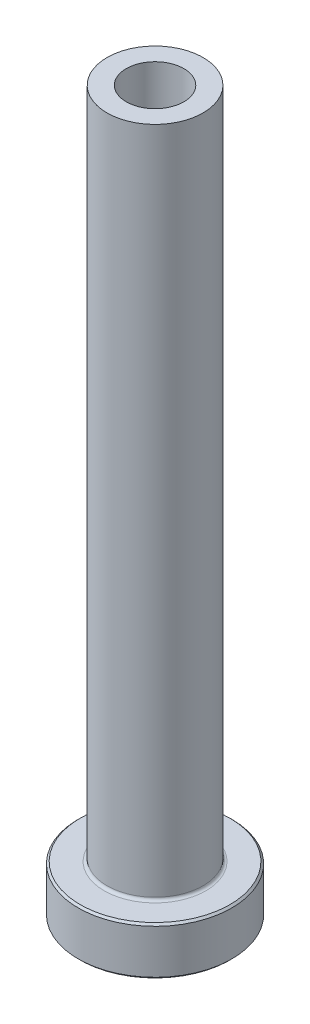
ISO-10303-21;
HEADER;
FILE_DESCRIPTION(('STEP AP214'),'2;1');
FILE_NAME('part.step','',(''),(''),'','','');
FILE_SCHEMA(('AUTOMOTIVE_DESIGN { 1 0 10303 214 1 1 1 1 }'));
ENDSEC;
DATA;
#1=APPLICATION_CONTEXT('core data for automotive mechanical design processes');
#2=APPLICATION_PROTOCOL_DEFINITION('international standard','automotive_design',2000,#1);
#3=PRODUCT_CONTEXT('',#1,'mechanical');
#4=PRODUCT('Part','Part','',(#3));
#5=PRODUCT_RELATED_PRODUCT_CATEGORY('part','',(#4));
#6=PRODUCT_DEFINITION_FORMATION('','',#4);
#7=PRODUCT_DEFINITION_CONTEXT('part definition',#1,'design');
#8=PRODUCT_DEFINITION('design','',#6,#7);
#9=PRODUCT_DEFINITION_SHAPE('','',#8);
#10=(LENGTH_UNIT() NAMED_UNIT(*) SI_UNIT(.MILLI.,.METRE.));
#11=(NAMED_UNIT(*) PLANE_ANGLE_UNIT() SI_UNIT($,.RADIAN.));
#12=(NAMED_UNIT(*) SI_UNIT($,.STERADIAN.) SOLID_ANGLE_UNIT());
#13=UNCERTAINTY_MEASURE_WITH_UNIT(LENGTH_MEASURE(1.E-05),#10,'distance_accuracy_value','');
#14=(GEOMETRIC_REPRESENTATION_CONTEXT(3) GLOBAL_UNCERTAINTY_ASSIGNED_CONTEXT((#13)) GLOBAL_UNIT_ASSIGNED_CONTEXT((#10,
#11,#12)) REPRESENTATION_CONTEXT('',''));
#15=CARTESIAN_POINT('',(0.,0.,0.));
#16=DIRECTION('',(0.,0.,1.));
#17=DIRECTION('',(1.,0.,0.));
#18=AXIS2_PLACEMENT_3D('',#15,#16,#17);
#19=CARTESIAN_POINT('',(0.,92.1876809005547,0.));
#20=DIRECTION('',(0.,1.,0.));
#21=DIRECTION('',(0.,0.,1.));
#22=AXIS2_PLACEMENT_3D('',#19,#20,#21);
#23=CYLINDRICAL_SURFACE('',#22,3.00000000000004);
#24=CARTESIAN_POINT('',(0.,75.,0.));
#25=DIRECTION('',(0.,1.,0.));
#26=DIRECTION('',(0.,0.,1.));
#27=AXIS2_PLACEMENT_3D('',#24,#25,#26);
#28=CIRCLE('',#27,3.00000000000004);
#29=CARTESIAN_POINT('',(0.,75.,3.00000000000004));
#30=VERTEX_POINT('',#29);
#31=EDGE_CURVE('E62',#30,#30,#28,.T.);
#32=ORIENTED_EDGE('',*,*,#31,.T.);
#33=EDGE_LOOP('',(#32));
#34=FACE_BOUND('',#33,.T.);
#35=CARTESIAN_POINT('',(0.,30.,0.));
#36=DIRECTION('',(0.,1.,0.));
#37=DIRECTION('',(0.,0.,1.));
#38=AXIS2_PLACEMENT_3D('',#35,#36,#37);
#39=CIRCLE('',#38,3.00000000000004);
#40=CARTESIAN_POINT('',(0.,30.,3.00000000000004));
#41=VERTEX_POINT('',#40);
#42=EDGE_CURVE('E71',#41,#41,#39,.T.);
#43=ORIENTED_EDGE('',*,*,#42,.F.);
#44=EDGE_LOOP('',(#43));
#45=FACE_BOUND('',#44,.T.);
#46=ADVANCED_FACE('F30',(#34,#45),#23,.F.);
#47=CARTESIAN_POINT('',(-3.00000000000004,75.,0.));
#48=DIRECTION('',(0.,1.,0.));
#49=DIRECTION('',(0.,0.,1.));
#50=AXIS2_PLACEMENT_3D('',#47,#48,#49);
#51=PLANE('',#50);
#52=CARTESIAN_POINT('',(0.,75.,0.));
#53=DIRECTION('',(0.,1.,0.));
#54=DIRECTION('',(0.,0.,1.));
#55=AXIS2_PLACEMENT_3D('',#52,#53,#54);
#56=CIRCLE('',#55,5.);
#57=CARTESIAN_POINT('',(0.,75.,5.));
#58=VERTEX_POINT('',#57);
#59=EDGE_CURVE('E65',#58,#58,#56,.T.);
#60=ORIENTED_EDGE('',*,*,#59,.T.);
#61=EDGE_LOOP('',(#60));
#62=FACE_BOUND('',#61,.T.);
#63=ORIENTED_EDGE('',*,*,#31,.F.);
#64=EDGE_LOOP('',(#63));
#65=FACE_BOUND('',#64,.T.);
#66=ADVANCED_FACE('F79',(#62,#65),#51,.T.);
#67=CARTESIAN_POINT('',(0.,92.1876809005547,0.));
#68=DIRECTION('',(0.,1.,0.));
#69=DIRECTION('',(0.,0.,1.));
#70=AXIS2_PLACEMENT_3D('',#67,#68,#69);
#71=CYLINDRICAL_SURFACE('',#70,4.99999999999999);
#72=CARTESIAN_POINT('',(0.,5.3,0.));
#73=DIRECTION('',(0.,1.,0.));
#74=DIRECTION('',(0.,0.,1.));
#75=AXIS2_PLACEMENT_3D('',#72,#73,#74);
#76=CIRCLE('',#75,4.99999999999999);
#77=CARTESIAN_POINT('',(0.,5.3,4.99999999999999));
#78=VERTEX_POINT('',#77);
#79=EDGE_CURVE('E59',#78,#78,#76,.T.);
#80=ORIENTED_EDGE('',*,*,#79,.T.);
#81=EDGE_LOOP('',(#80));
#82=FACE_BOUND('',#81,.T.);
#83=ORIENTED_EDGE('',*,*,#59,.F.);
#84=EDGE_LOOP('',(#83));
#85=FACE_BOUND('',#84,.T.);
#86=ADVANCED_FACE('F85',(#82,#85),#71,.T.);
#87=CARTESIAN_POINT('',(-4.99999999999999,5.,0.));
#88=DIRECTION('',(0.,1.,0.));
#89=DIRECTION('',(0.,0.,1.));
#90=AXIS2_PLACEMENT_3D('',#87,#88,#89);
#91=PLANE('',#90);
#92=CARTESIAN_POINT('',(0.,5.,0.));
#93=DIRECTION('',(0.,1.,0.));
#94=DIRECTION('',(0.,0.,1.));
#95=AXIS2_PLACEMENT_3D('',#92,#93,#94);
#96=CIRCLE('',#95,7.80000000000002);
#97=CARTESIAN_POINT('',(0.,5.,-7.80000000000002));
#98=VERTEX_POINT('',#97);
#99=EDGE_CURVE('E53',#98,#98,#96,.T.);
#100=ORIENTED_EDGE('',*,*,#99,.T.);
#101=EDGE_LOOP('',(#100));
#102=FACE_BOUND('',#101,.T.);
#103=CARTESIAN_POINT('',(0.,5.,0.));
#104=DIRECTION('',(0.,1.,0.));
#105=DIRECTION('',(0.,0.,1.));
#106=AXIS2_PLACEMENT_3D('',#103,#104,#105);
#107=CIRCLE('',#106,5.29999999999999);
#108=CARTESIAN_POINT('',(0.,5.,5.29999999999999));
#109=VERTEX_POINT('',#108);
#110=EDGE_CURVE('E56',#109,#109,#107,.F.);
#111=ORIENTED_EDGE('',*,*,#110,.T.);
#112=EDGE_LOOP('',(#111));
#113=FACE_BOUND('',#112,.T.);
#114=ADVANCED_FACE('F111',(#102,#113),#91,.T.);
#115=CARTESIAN_POINT('',(0.,92.1876809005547,0.));
#116=DIRECTION('',(0.,1.,0.));
#117=DIRECTION('',(0.,0.,1.));
#118=AXIS2_PLACEMENT_3D('',#115,#116,#117);
#119=CYLINDRICAL_SURFACE('',#118,7.99999999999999);
#120=CARTESIAN_POINT('',(0.,4.80000000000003,0.));
#121=DIRECTION('',(0.,1.,0.));
#122=DIRECTION('',(0.,0.,1.));
#123=AXIS2_PLACEMENT_3D('',#120,#121,#122);
#124=CIRCLE('',#123,7.99999999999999);
#125=CARTESIAN_POINT('',(0.,4.80000000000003,-7.99999999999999));
#126=VERTEX_POINT('',#125);
#127=EDGE_CURVE('E45',#126,#126,#124,.F.);
#128=ORIENTED_EDGE('',*,*,#127,.T.);
#129=EDGE_LOOP('',(#128));
#130=FACE_BOUND('',#129,.T.);
#131=CARTESIAN_POINT('',(0.,0.199999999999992,0.));
#132=DIRECTION('',(0.,-1.,0.));
#133=DIRECTION('',(0.,0.,-1.));
#134=AXIS2_PLACEMENT_3D('',#131,#132,#133);
#135=CIRCLE('',#134,7.99999999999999);
#136=CARTESIAN_POINT('',(0.,0.199999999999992,-7.99999999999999));
#137=VERTEX_POINT('',#136);
#138=EDGE_CURVE('E50',#137,#137,#135,.F.);
#139=ORIENTED_EDGE('',*,*,#138,.T.);
#140=EDGE_LOOP('',(#139));
#141=FACE_BOUND('',#140,.T.);
#142=ADVANCED_FACE('F108',(#130,#141),#119,.T.);
#143=CARTESIAN_POINT('',(-7.99999999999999,0.,0.));
#144=DIRECTION('',(0.,-1.,0.));
#145=DIRECTION('',(0.,0.,-1.));
#146=AXIS2_PLACEMENT_3D('',#143,#144,#145);
#147=PLANE('',#146);
#148=CARTESIAN_POINT('',(0.,0.,0.));
#149=DIRECTION('',(0.,-1.,0.));
#150=DIRECTION('',(0.,0.,-1.));
#151=AXIS2_PLACEMENT_3D('',#148,#149,#150);
#152=CIRCLE('',#151,3.74999999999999);
#153=CARTESIAN_POINT('',(0.,0.,-3.74999999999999));
#154=VERTEX_POINT('',#153);
#155=EDGE_CURVE('E37',#154,#154,#152,.F.);
#156=ORIENTED_EDGE('',*,*,#155,.T.);
#157=EDGE_LOOP('',(#156));
#158=FACE_BOUND('',#157,.T.);
#159=CARTESIAN_POINT('',(0.,0.,0.));
#160=DIRECTION('',(0.,-1.,0.));
#161=DIRECTION('',(0.,0.,-1.));
#162=AXIS2_PLACEMENT_3D('',#159,#160,#161);
#163=CIRCLE('',#162,7.79999999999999);
#164=CARTESIAN_POINT('',(0.,0.,-7.79999999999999));
#165=VERTEX_POINT('',#164);
#166=EDGE_CURVE('E41',#165,#165,#163,.T.);
#167=ORIENTED_EDGE('',*,*,#166,.T.);
#168=EDGE_LOOP('',(#167));
#169=FACE_BOUND('',#168,.T.);
#170=ADVANCED_FACE('F110',(#158,#169),#147,.T.);
#171=CARTESIAN_POINT('',(0.,92.1876809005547,0.));
#172=DIRECTION('',(0.,1.,0.));
#173=DIRECTION('',(0.,0.,1.));
#174=AXIS2_PLACEMENT_3D('',#171,#172,#173);
#175=CYLINDRICAL_SURFACE('',#174,3.24999999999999);
#176=CARTESIAN_POINT('',(0.,0.5,0.));
#177=DIRECTION('',(0.,-1.,0.));
#178=DIRECTION('',(0.,0.,-1.));
#179=AXIS2_PLACEMENT_3D('',#176,#177,#178);
#180=CIRCLE('',#179,3.24999999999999);
#181=CARTESIAN_POINT('',(0.,0.5,-3.24999999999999));
#182=VERTEX_POINT('',#181);
#183=EDGE_CURVE('E10',#182,#182,#180,.T.);
#184=ORIENTED_EDGE('',*,*,#183,.T.);
#185=EDGE_LOOP('',(#184));
#186=FACE_BOUND('',#185,.T.);
#187=CARTESIAN_POINT('',(0.,18.,0.));
#188=DIRECTION('',(0.,1.,0.));
#189=DIRECTION('',(0.,0.,1.));
#190=AXIS2_PLACEMENT_3D('',#187,#188,#189);
#191=CIRCLE('',#190,3.24999999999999);
#192=CARTESIAN_POINT('',(0.,18.,3.24999999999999));
#193=VERTEX_POINT('',#192);
#194=EDGE_CURVE('E68',#193,#193,#191,.T.);
#195=ORIENTED_EDGE('',*,*,#194,.T.);
#196=EDGE_LOOP('',(#195));
#197=FACE_BOUND('',#196,.T.);
#198=ADVANCED_FACE('F118',(#186,#197),#175,.F.);
#199=CARTESIAN_POINT('',(0.,18.,0.));
#200=DIRECTION('',(0.,-1.,0.));
#201=DIRECTION('',(0.,0.,-1.));
#202=AXIS2_PLACEMENT_3D('',#199,#200,#201);
#203=CONICAL_SURFACE('',#202,3.24999999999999,0.0208303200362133);
#204=ORIENTED_EDGE('',*,*,#42,.T.);
#205=EDGE_LOOP('',(#204));
#206=FACE_BOUND('',#205,.T.);
#207=ORIENTED_EDGE('',*,*,#194,.F.);
#208=EDGE_LOOP('',(#207));
#209=FACE_BOUND('',#208,.T.);
#210=ADVANCED_FACE('F75',(#206,#209),#203,.F.);
#211=CARTESIAN_POINT('',(0.,5.3,0.));
#212=DIRECTION('',(0.,1.,0.));
#213=DIRECTION('',(0.,0.,1.));
#214=AXIS2_PLACEMENT_3D('',#211,#212,#213);
#215=TOROIDAL_SURFACE('',#214,5.29999999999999,0.3);
#216=ORIENTED_EDGE('',*,*,#110,.F.);
#217=EDGE_LOOP('',(#216));
#218=FACE_BOUND('',#217,.T.);
#219=ORIENTED_EDGE('',*,*,#79,.F.);
#220=EDGE_LOOP('',(#219));
#221=FACE_BOUND('',#220,.T.);
#222=ADVANCED_FACE('F90',(#218,#221),#215,.F.);
#223=CARTESIAN_POINT('',(0.,5.,0.));
#224=DIRECTION('',(0.,-1.,0.));
#225=DIRECTION('',(0.,0.,-1.));
#226=AXIS2_PLACEMENT_3D('',#223,#224,#225);
#227=CONICAL_SURFACE('',#226,7.80000000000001,0.78539816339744);
#228=CARTESIAN_POINT('',(0.,4.80000000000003,-7.99999999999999));
#229=CARTESIAN_POINT('',(0.,4.80208333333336,-7.99791666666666));
#230=CARTESIAN_POINT('',(0.,4.80416666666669,-7.99583333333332));
#231=CARTESIAN_POINT('',(0.,4.80833333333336,-7.99166666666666));
#232=CARTESIAN_POINT('',(0.,4.81041666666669,-7.98958333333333));
#233=CARTESIAN_POINT('',(0.,4.81458333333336,-7.98541666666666));
#234=CARTESIAN_POINT('',(0.,4.81666666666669,-7.98333333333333));
#235=CARTESIAN_POINT('',(0.,4.82083333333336,-7.97916666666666));
#236=CARTESIAN_POINT('',(0.,4.82291666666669,-7.97708333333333));
#237=CARTESIAN_POINT('',(0.,4.82708333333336,-7.97291666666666));
#238=CARTESIAN_POINT('',(0.,4.82916666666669,-7.97083333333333));
#239=CARTESIAN_POINT('',(0.,4.83333333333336,-7.96666666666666));
#240=CARTESIAN_POINT('',(0.,4.83541666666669,-7.96458333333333));
#241=CARTESIAN_POINT('',(0.,4.83958333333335,-7.96041666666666));
#242=CARTESIAN_POINT('',(0.,4.84166666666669,-7.95833333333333));
#243=CARTESIAN_POINT('',(0.,4.84583333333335,-7.95416666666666));
#244=CARTESIAN_POINT('',(0.,4.84791666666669,-7.95208333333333));
#245=CARTESIAN_POINT('',(0.,4.85208333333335,-7.94791666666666));
#246=CARTESIAN_POINT('',(0.,4.85416666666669,-7.94583333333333));
#247=CARTESIAN_POINT('',(0.,4.85833333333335,-7.94166666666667));
#248=CARTESIAN_POINT('',(0.,4.86041666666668,-7.93958333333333));
#249=CARTESIAN_POINT('',(0.,4.86458333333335,-7.93541666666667));
#250=CARTESIAN_POINT('',(0.,4.86666666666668,-7.93333333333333));
#251=CARTESIAN_POINT('',(0.,4.87083333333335,-7.92916666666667));
#252=CARTESIAN_POINT('',(0.,4.87291666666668,-7.92708333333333));
#253=CARTESIAN_POINT('',(0.,4.87708333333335,-7.92291666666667));
#254=CARTESIAN_POINT('',(0.,4.87916666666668,-7.92083333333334));
#255=CARTESIAN_POINT('',(0.,4.88333333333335,-7.91666666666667));
#256=CARTESIAN_POINT('',(0.,4.88541666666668,-7.91458333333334));
#257=CARTESIAN_POINT('',(0.,4.88958333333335,-7.91041666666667));
#258=CARTESIAN_POINT('',(0.,4.89166666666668,-7.90833333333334));
#259=CARTESIAN_POINT('',(0.,4.89583333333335,-7.90416666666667));
#260=CARTESIAN_POINT('',(0.,4.89791666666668,-7.90208333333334));
#261=CARTESIAN_POINT('',(0.,4.90208333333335,-7.89791666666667));
#262=CARTESIAN_POINT('',(0.,4.90416666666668,-7.89583333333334));
#263=CARTESIAN_POINT('',(0.,4.90833333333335,-7.89166666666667));
#264=CARTESIAN_POINT('',(0.,4.91041666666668,-7.88958333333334));
#265=CARTESIAN_POINT('',(0.,4.91458333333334,-7.88541666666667));
#266=CARTESIAN_POINT('',(0.,4.91666666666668,-7.88333333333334));
#267=CARTESIAN_POINT('',(0.,4.92083333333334,-7.87916666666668));
#268=CARTESIAN_POINT('',(0.,4.92291666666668,-7.87708333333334));
#269=CARTESIAN_POINT('',(0.,4.92708333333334,-7.87291666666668));
#270=CARTESIAN_POINT('',(0.,4.92916666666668,-7.87083333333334));
#271=CARTESIAN_POINT('',(0.,4.93333333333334,-7.86666666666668));
#272=CARTESIAN_POINT('',(0.,4.93541666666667,-7.86458333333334));
#273=CARTESIAN_POINT('',(0.,4.93958333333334,-7.86041666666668));
#274=CARTESIAN_POINT('',(0.,4.94166666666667,-7.85833333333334));
#275=CARTESIAN_POINT('',(0.,4.94583333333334,-7.85416666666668));
#276=CARTESIAN_POINT('',(0.,4.94791666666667,-7.85208333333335));
#277=CARTESIAN_POINT('',(0.,4.95208333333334,-7.84791666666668));
#278=CARTESIAN_POINT('',(0.,4.95416666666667,-7.84583333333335));
#279=CARTESIAN_POINT('',(0.,4.95833333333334,-7.84166666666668));
#280=CARTESIAN_POINT('',(0.,4.96041666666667,-7.83958333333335));
#281=CARTESIAN_POINT('',(0.,4.96458333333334,-7.83541666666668));
#282=CARTESIAN_POINT('',(0.,4.96666666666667,-7.83333333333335));
#283=CARTESIAN_POINT('',(0.,4.97083333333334,-7.82916666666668));
#284=CARTESIAN_POINT('',(0.,4.97291666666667,-7.82708333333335));
#285=CARTESIAN_POINT('',(0.,4.97708333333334,-7.82291666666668));
#286=CARTESIAN_POINT('',(0.,4.97916666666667,-7.82083333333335));
#287=CARTESIAN_POINT('',(0.,4.98333333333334,-7.81666666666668));
#288=CARTESIAN_POINT('',(0.,4.98541666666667,-7.81458333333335));
#289=CARTESIAN_POINT('',(0.,4.98958333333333,-7.81041666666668));
#290=CARTESIAN_POINT('',(0.,4.99166666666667,-7.80833333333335));
#291=CARTESIAN_POINT('',(0.,4.99583333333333,-7.80416666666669));
#292=CARTESIAN_POINT('',(0.,4.99791666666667,-7.80208333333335));
#293=CARTESIAN_POINT('',(0.,5.,-7.80000000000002));
#294=B_SPLINE_CURVE_WITH_KNOTS('',3,(#228,#229,#230,#231,#232,#233,#234,#235,#236,#237,#238,
#239,#240,#241,#242,#243,#244,#245,#246,#247,#248,#249,#250,#251,#252,#253,#254,#255,#256,#257,
#258,#259,#260,#261,#262,#263,#264,#265,#266,#267,#268,#269,#270,#271,#272,#273,#274,#275,#276,
#277,#278,#279,#280,#281,#282,#283,#284,#285,#286,#287,#288,#289,#290,#291,#292,#293),
.UNSPECIFIED.,.F.,.F.,(4,2,2,2,2,2,2,2,2,2,2,2,2,2,2,2,2,2,2,2,2,2,2,2,2,2,2,2,2,2,2,2,4),(0.,
0.00883883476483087,0.0176776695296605,0.0265165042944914,0.0353553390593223,0.0441941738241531,
0.053033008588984,0.0618718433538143,0.0707106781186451,0.0795495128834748,0.0883883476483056,
0.0972271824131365,0.106066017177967,0.114904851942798,0.123743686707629,0.132582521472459,
0.141421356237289,0.15026019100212,0.159099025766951,0.167937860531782,0.176776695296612,
0.185615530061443,0.194454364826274,0.203293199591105,0.212132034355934,0.220970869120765,
0.229809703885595,0.238648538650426,0.247487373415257,0.256326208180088,0.265165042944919,
0.274003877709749,0.28284271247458),.UNSPECIFIED.);
#295=EDGE_CURVE('BSEAM93',#126,#98,#294,.T.);
#296=ORIENTED_EDGE('',*,*,#127,.F.);
#297=ORIENTED_EDGE('',*,*,#99,.F.);
#298=ORIENTED_EDGE('',*,*,#295,.T.);
#299=ORIENTED_EDGE('',*,*,#295,.F.);
#300=EDGE_LOOP('',(#296,#298,#297,#299));
#301=FACE_BOUND('',#300,.T.);
#302=ADVANCED_FACE('F93',(#301),#227,.T.);
#303=CARTESIAN_POINT('',(0.,0.199999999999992,0.));
#304=DIRECTION('',(0.,1.,0.));
#305=DIRECTION('',(0.,0.,1.));
#306=AXIS2_PLACEMENT_3D('',#303,#304,#305);
#307=CONICAL_SURFACE('',#306,7.99999999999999,0.785398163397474);
#308=ORIENTED_EDGE('',*,*,#166,.F.);
#309=EDGE_LOOP('',(#308));
#310=FACE_BOUND('',#309,.T.);
#311=ORIENTED_EDGE('',*,*,#138,.F.);
#312=EDGE_LOOP('',(#311));
#313=FACE_BOUND('',#312,.T.);
#314=ADVANCED_FACE('F96',(#310,#313),#307,.T.);
#315=CARTESIAN_POINT('',(0.,0.,0.));
#316=DIRECTION('',(0.,-1.,0.));
#317=DIRECTION('',(0.,0.,-1.));
#318=AXIS2_PLACEMENT_3D('',#315,#316,#317);
#319=CONICAL_SURFACE('',#318,3.74999999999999,0.785398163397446);
#320=ORIENTED_EDGE('',*,*,#183,.F.);
#321=EDGE_LOOP('',(#320));
#322=FACE_BOUND('',#321,.T.);
#323=ORIENTED_EDGE('',*,*,#155,.F.);
#324=EDGE_LOOP('',(#323));
#325=FACE_BOUND('',#324,.T.);
#326=ADVANCED_FACE('F32',(#322,#325),#319,.F.);
#327=CLOSED_SHELL('',(#46,#66,#86,#114,#142,#170,#198,#210,#222,#302,#314,#326));
#328=MANIFOLD_SOLID_BREP('B2',#327);
#329=ADVANCED_BREP_SHAPE_REPRESENTATION('',(#18,#328),#14);
#330=SHAPE_DEFINITION_REPRESENTATION(#9,#329);
ENDSEC;
END-ISO-10303-21;
